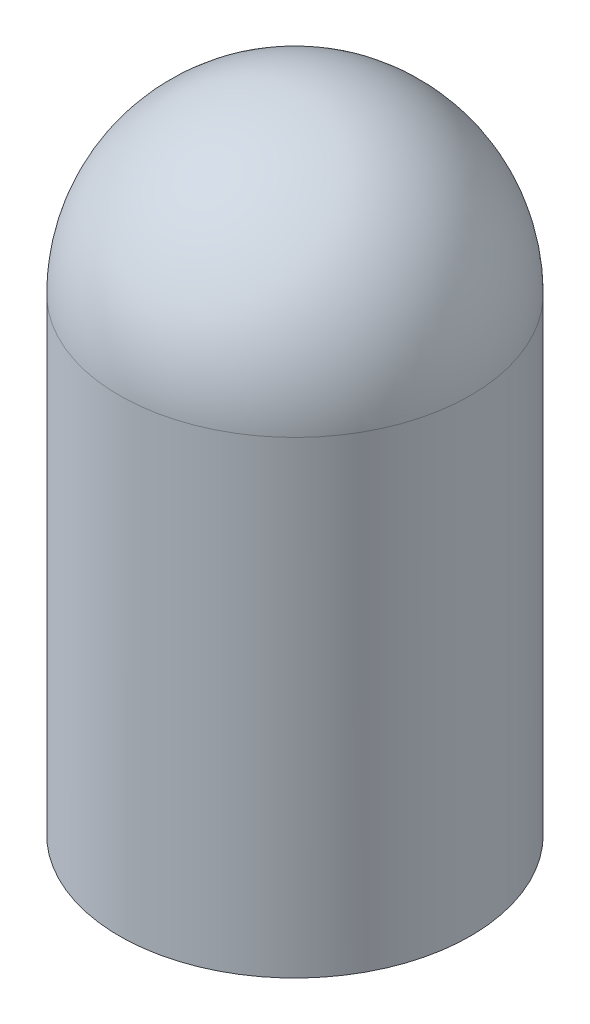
ISO-10303-21;
HEADER;
FILE_DESCRIPTION(('STEP AP214'),'2;1');
FILE_NAME('part.step','',(''),(''),'','','');
FILE_SCHEMA(('AUTOMOTIVE_DESIGN { 1 0 10303 214 1 1 1 1 }'));
ENDSEC;
DATA;
#1=APPLICATION_CONTEXT('core data for automotive mechanical design processes');
#2=APPLICATION_PROTOCOL_DEFINITION('international standard','automotive_design',2000,#1);
#3=PRODUCT_CONTEXT('',#1,'mechanical');
#4=PRODUCT('Part','Part','',(#3));
#5=PRODUCT_RELATED_PRODUCT_CATEGORY('part','',(#4));
#6=PRODUCT_DEFINITION_FORMATION('','',#4);
#7=PRODUCT_DEFINITION_CONTEXT('part definition',#1,'design');
#8=PRODUCT_DEFINITION('design','',#6,#7);
#9=PRODUCT_DEFINITION_SHAPE('','',#8);
#10=(LENGTH_UNIT() NAMED_UNIT(*) SI_UNIT(.MILLI.,.METRE.));
#11=(NAMED_UNIT(*) PLANE_ANGLE_UNIT() SI_UNIT($,.RADIAN.));
#12=(NAMED_UNIT(*) SI_UNIT($,.STERADIAN.) SOLID_ANGLE_UNIT());
#13=UNCERTAINTY_MEASURE_WITH_UNIT(LENGTH_MEASURE(1.E-05),#10,'distance_accuracy_value','');
#14=(GEOMETRIC_REPRESENTATION_CONTEXT(3) GLOBAL_UNCERTAINTY_ASSIGNED_CONTEXT((#13)) GLOBAL_UNIT_ASSIGNED_CONTEXT((#10,
#11,#12)) REPRESENTATION_CONTEXT('',''));
#15=CARTESIAN_POINT('',(0.,0.,0.));
#16=DIRECTION('',(0.,0.,1.));
#17=DIRECTION('',(1.,0.,0.));
#18=AXIS2_PLACEMENT_3D('',#15,#16,#17);
#19=CARTESIAN_POINT('',(0.,4.,0.));
#20=DIRECTION('',(0.,-1.,0.));
#21=DIRECTION('',(1.,0.,0.));
#22=AXIS2_PLACEMENT_3D('',#19,#20,#21);
#23=SPHERICAL_SURFACE('',#22,1.5);
#24=CARTESIAN_POINT('',(0.,4.,0.));
#25=DIRECTION('',(0.,-1.,0.));
#26=DIRECTION('',(0.,0.,-1.));
#27=AXIS2_PLACEMENT_3D('',#24,#25,#26);
#28=CIRCLE('',#27,1.5);
#29=CARTESIAN_POINT('',(0.,4.,-1.5));
#30=VERTEX_POINT('',#29);
#31=EDGE_CURVE('E36',#30,#30,#28,.T.);
#32=ORIENTED_EDGE('',*,*,#31,.F.);
#33=EDGE_LOOP('',(#32));
#34=FACE_BOUND('',#33,.T.);
#35=ADVANCED_FACE('F22',(#34),#23,.T.);
#36=CARTESIAN_POINT('',(0.,4.,0.));
#37=DIRECTION('',(0.,-1.,0.));
#38=DIRECTION('',(1.,0.,0.));
#39=AXIS2_PLACEMENT_3D('',#36,#37,#38);
#40=SPHERICAL_SURFACE('',#39,1.3);
#41=CARTESIAN_POINT('',(0.,4.,0.));
#42=DIRECTION('',(0.,-1.,0.));
#43=DIRECTION('',(0.,0.,-1.));
#44=AXIS2_PLACEMENT_3D('',#41,#42,#43);
#45=CIRCLE('',#44,1.3);
#46=CARTESIAN_POINT('',(0.,4.,-1.3));
#47=VERTEX_POINT('',#46);
#48=EDGE_CURVE('E10',#47,#47,#45,.T.);
#49=ORIENTED_EDGE('',*,*,#48,.T.);
#50=EDGE_LOOP('',(#49));
#51=FACE_BOUND('',#50,.T.);
#52=ADVANCED_FACE('F46',(#51),#40,.F.);
#53=CARTESIAN_POINT('',(0.,0.,0.));
#54=DIRECTION('',(0.,-1.,0.));
#55=DIRECTION('',(0.,0.,-1.));
#56=AXIS2_PLACEMENT_3D('',#53,#54,#55);
#57=CYLINDRICAL_SURFACE('',#56,1.3);
#58=ORIENTED_EDGE('',*,*,#48,.F.);
#59=EDGE_LOOP('',(#58));
#60=FACE_BOUND('',#59,.T.);
#61=CARTESIAN_POINT('',(0.,0.,0.));
#62=DIRECTION('',(0.,-1.,0.));
#63=DIRECTION('',(0.,0.,-1.));
#64=AXIS2_PLACEMENT_3D('',#61,#62,#63);
#65=CIRCLE('',#64,1.3);
#66=CARTESIAN_POINT('',(0.,0.,-1.3));
#67=VERTEX_POINT('',#66);
#68=EDGE_CURVE('E28',#67,#67,#65,.T.);
#69=ORIENTED_EDGE('',*,*,#68,.T.);
#70=EDGE_LOOP('',(#69));
#71=FACE_BOUND('',#70,.T.);
#72=ADVANCED_FACE('F50',(#60,#71),#57,.F.);
#73=CARTESIAN_POINT('',(1.5,0.,0.));
#74=DIRECTION('',(0.,1.,0.));
#75=DIRECTION('',(0.,0.,1.));
#76=AXIS2_PLACEMENT_3D('',#73,#74,#75);
#77=PLANE('',#76);
#78=ORIENTED_EDGE('',*,*,#68,.F.);
#79=EDGE_LOOP('',(#78));
#80=FACE_BOUND('',#79,.T.);
#81=CARTESIAN_POINT('',(0.,0.,0.));
#82=DIRECTION('',(0.,-1.,0.));
#83=DIRECTION('',(0.,0.,-1.));
#84=AXIS2_PLACEMENT_3D('',#81,#82,#83);
#85=CIRCLE('',#84,1.5);
#86=CARTESIAN_POINT('',(0.,0.,-1.5));
#87=VERTEX_POINT('',#86);
#88=EDGE_CURVE('E32',#87,#87,#85,.T.);
#89=ORIENTED_EDGE('',*,*,#88,.T.);
#90=EDGE_LOOP('',(#89));
#91=FACE_BOUND('',#90,.T.);
#92=ADVANCED_FACE('F54',(#80,#91),#77,.F.);
#93=CARTESIAN_POINT('',(0.,0.,0.));
#94=DIRECTION('',(0.,-1.,0.));
#95=DIRECTION('',(0.,0.,-1.));
#96=AXIS2_PLACEMENT_3D('',#93,#94,#95);
#97=CYLINDRICAL_SURFACE('',#96,1.5);
#98=ORIENTED_EDGE('',*,*,#31,.T.);
#99=EDGE_LOOP('',(#98));
#100=FACE_BOUND('',#99,.T.);
#101=ORIENTED_EDGE('',*,*,#88,.F.);
#102=EDGE_LOOP('',(#101));
#103=FACE_BOUND('',#102,.T.);
#104=ADVANCED_FACE('F42',(#100,#103),#97,.T.);
#105=CLOSED_SHELL('',(#35,#52,#72,#92,#104));
#106=MANIFOLD_SOLID_BREP('B2',#105);
#107=ADVANCED_BREP_SHAPE_REPRESENTATION('',(#18,#106),#14);
#108=SHAPE_DEFINITION_REPRESENTATION(#9,#107);
ENDSEC;
END-ISO-10303-21;
